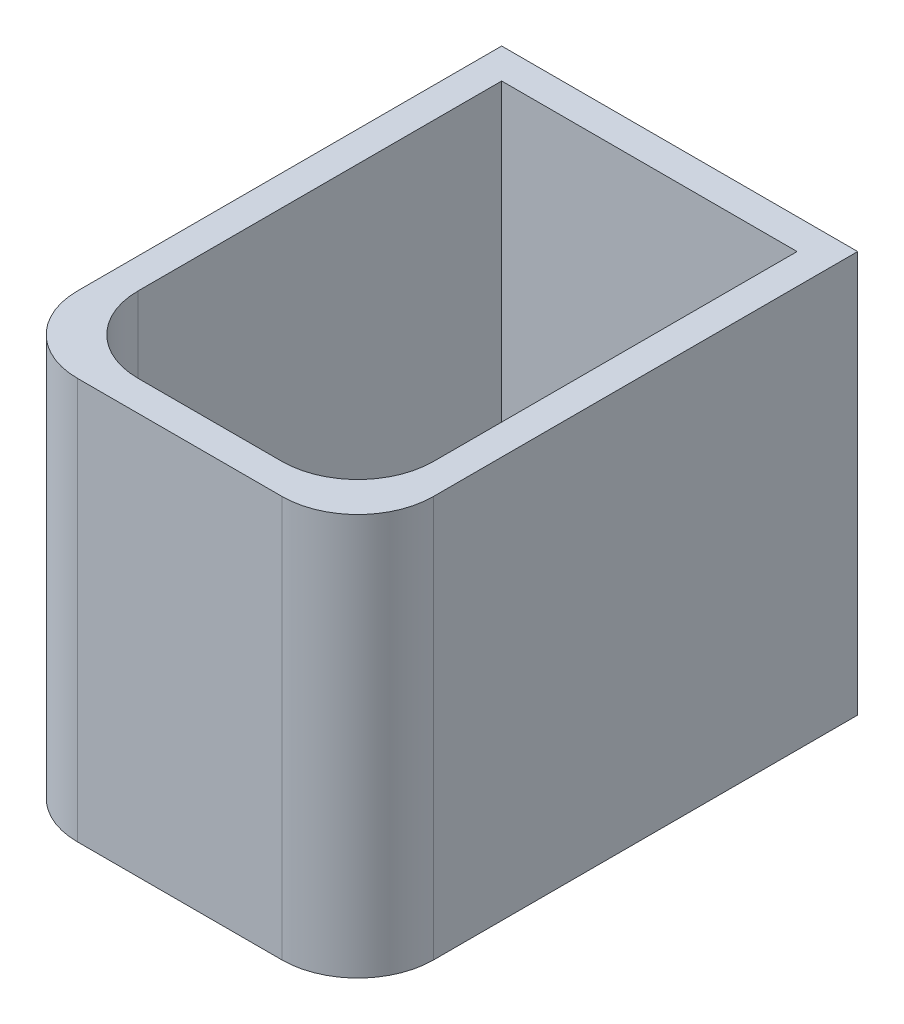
from build123d import *

# Parameters (mm, degrees)
SKETCH_1_W      = 4.7
SKETCH_1_H      = 6.6
EXTRUDE_1_DEPTH = 0.3
SKETCH_2_W      = 4.7
SKETCH_2_H      = 6.6
SKETCH_2_W_2    = 3.9
SKETCH_2_H_2    = 5.8
EXTRUDE_2_DEPTH = 5
FILLET_1_R      = 1


with BuildPart() as part:
    # Sketch 1 → Extrude 1 (new body)
    with BuildSketch(Plane(origin=(0, 0, 0), x_dir=(1, 0, 0), z_dir=(0, 1, 0))):
        Rectangle(SKETCH_1_W, SKETCH_1_H)
    extrude(amount=EXTRUDE_1_DEPTH)

    # Sketch 2 → Extrude 2 (add)
    with BuildSketch(Plane(origin=(0, 0.3, 0), x_dir=(1, 0, 0), z_dir=(0, 1, 0))):
        Rectangle(SKETCH_2_W, SKETCH_2_H)
        Rectangle(SKETCH_2_W_2, SKETCH_2_H_2, mode=Mode.SUBTRACT)
    extrude(amount=EXTRUDE_2_DEPTH)

    # Fillet 1
    fillet_1_edges = [part.edges().sort_by_distance(p)[0] for p in [
        (-1.95, 2.8, 2.9),
        (1.95, 2.8, 2.9),
        (2.35, 2.65, 3.3),
        (-2.35, 2.65, 3.3),
    ]]
    fillet(fillet_1_edges, radius=FILLET_1_R)


solid = part.part
